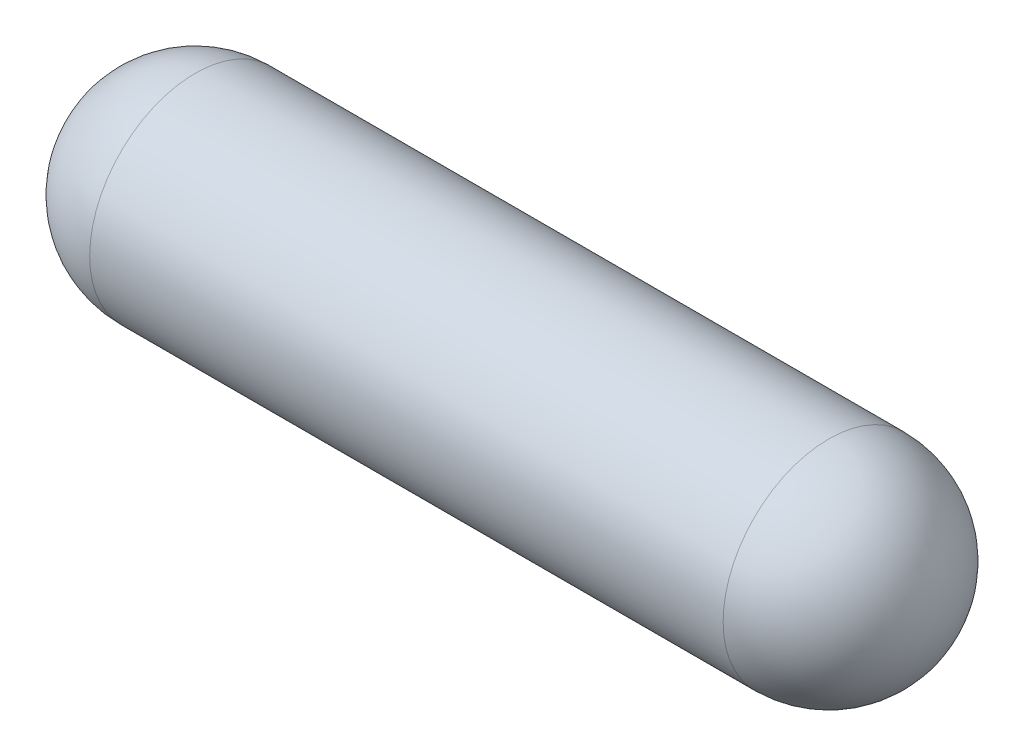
ISO-10303-21;
HEADER;
FILE_DESCRIPTION(('STEP AP214'),'2;1');
FILE_NAME('part.step','',(''),(''),'','','');
FILE_SCHEMA(('AUTOMOTIVE_DESIGN { 1 0 10303 214 1 1 1 1 }'));
ENDSEC;
DATA;
#1=APPLICATION_CONTEXT('core data for automotive mechanical design processes');
#2=APPLICATION_PROTOCOL_DEFINITION('international standard','automotive_design',2000,#1);
#3=PRODUCT_CONTEXT('',#1,'mechanical');
#4=PRODUCT('Part','Part','',(#3));
#5=PRODUCT_RELATED_PRODUCT_CATEGORY('part','',(#4));
#6=PRODUCT_DEFINITION_FORMATION('','',#4);
#7=PRODUCT_DEFINITION_CONTEXT('part definition',#1,'design');
#8=PRODUCT_DEFINITION('design','',#6,#7);
#9=PRODUCT_DEFINITION_SHAPE('','',#8);
#10=(LENGTH_UNIT() NAMED_UNIT(*) SI_UNIT(.MILLI.,.METRE.));
#11=(NAMED_UNIT(*) PLANE_ANGLE_UNIT() SI_UNIT($,.RADIAN.));
#12=(NAMED_UNIT(*) SI_UNIT($,.STERADIAN.) SOLID_ANGLE_UNIT());
#13=UNCERTAINTY_MEASURE_WITH_UNIT(LENGTH_MEASURE(1.E-05),#10,'distance_accuracy_value','');
#14=(GEOMETRIC_REPRESENTATION_CONTEXT(3) GLOBAL_UNCERTAINTY_ASSIGNED_CONTEXT((#13)) GLOBAL_UNIT_ASSIGNED_CONTEXT((#10,
#11,#12)) REPRESENTATION_CONTEXT('',''));
#15=CARTESIAN_POINT('',(0.,0.,0.));
#16=DIRECTION('',(0.,0.,1.));
#17=DIRECTION('',(1.,0.,0.));
#18=AXIS2_PLACEMENT_3D('',#15,#16,#17);
#19=CARTESIAN_POINT('',(-9.,-55.,0.));
#20=DIRECTION('',(1.,0.,0.));
#21=DIRECTION('',(0.,0.,-1.));
#22=AXIS2_PLACEMENT_3D('',#19,#20,#21);
#23=CYLINDRICAL_SURFACE('',#22,1.5);
#24=CARTESIAN_POINT('',(0.,-55.,0.));
#25=DIRECTION('',(1.,0.,0.));
#26=DIRECTION('',(0.,1.,0.));
#27=AXIS2_PLACEMENT_3D('',#24,#25,#26);
#28=CIRCLE('',#27,1.5);
#29=CARTESIAN_POINT('',(0.,-55.,-1.5));
#30=VERTEX_POINT('',#29);
#31=CARTESIAN_POINT('',(0.,-55.,1.5));
#32=VERTEX_POINT('',#31);
#33=EDGE_CURVE('E11',#30,#32,#28,.T.);
#34=ORIENTED_EDGE('',*,*,#33,.F.);
#35=CARTESIAN_POINT('',(0.,-55.,0.));
#36=DIRECTION('',(-1.,0.,0.));
#37=DIRECTION('',(0.,-1.,0.));
#38=AXIS2_PLACEMENT_3D('',#35,#36,#37);
#39=CIRCLE('',#38,1.5);
#40=EDGE_CURVE('E24',#30,#32,#39,.T.);
#41=ORIENTED_EDGE('',*,*,#40,.T.);
#42=EDGE_LOOP('',(#34,#41));
#43=FACE_BOUND('',#42,.T.);
#44=CARTESIAN_POINT('',(-9.,-55.,0.));
#45=DIRECTION('',(1.,0.,0.));
#46=DIRECTION('',(0.,1.,0.));
#47=AXIS2_PLACEMENT_3D('',#44,#45,#46);
#48=CIRCLE('',#47,1.5);
#49=CARTESIAN_POINT('',(-9.,-55.,-1.5));
#50=VERTEX_POINT('',#49);
#51=CARTESIAN_POINT('',(-9.,-55.,1.5));
#52=VERTEX_POINT('',#51);
#53=EDGE_CURVE('E42',#50,#52,#48,.T.);
#54=ORIENTED_EDGE('',*,*,#53,.T.);
#55=CARTESIAN_POINT('',(-9.,-55.,0.));
#56=DIRECTION('',(-1.,0.,0.));
#57=DIRECTION('',(0.,-1.,0.));
#58=AXIS2_PLACEMENT_3D('',#55,#56,#57);
#59=CIRCLE('',#58,1.5);
#60=EDGE_CURVE('E30',#50,#52,#59,.T.);
#61=ORIENTED_EDGE('',*,*,#60,.F.);
#62=EDGE_LOOP('',(#54,#61));
#63=FACE_BOUND('',#62,.T.);
#64=ADVANCED_FACE('F16',(#43,#63),#23,.T.);
#65=CARTESIAN_POINT('',(0.,-55.,0.));
#66=DIRECTION('',(0.,0.,1.));
#67=DIRECTION('',(0.,1.,0.));
#68=AXIS2_PLACEMENT_3D('',#65,#66,#67);
#69=SPHERICAL_SURFACE('',#68,1.5);
#70=CARTESIAN_POINT('',(0.,-55.,0.));
#71=DIRECTION('',(1.,0.,0.));
#72=DIRECTION('',(0.,1.,0.));
#73=AXIS2_PLACEMENT_3D('',#70,#71,#72);
#74=SPHERICAL_SURFACE('',#73,1.5);
#75=ORIENTED_EDGE('',*,*,#33,.T.);
#76=ORIENTED_EDGE('',*,*,#40,.F.);
#77=EDGE_LOOP('',(#75,#76));
#78=FACE_BOUND('',#77,.T.);
#79=ADVANCED_FACE('F80',(#78),#74,.T.);
#80=CARTESIAN_POINT('',(-9.,-55.,0.));
#81=DIRECTION('',(0.,0.,1.));
#82=DIRECTION('',(0.,-1.,0.));
#83=AXIS2_PLACEMENT_3D('',#80,#81,#82);
#84=SPHERICAL_SURFACE('',#83,1.5);
#85=CARTESIAN_POINT('',(-9.,-55.,0.));
#86=DIRECTION('',(-1.,0.,0.));
#87=DIRECTION('',(0.,-1.,0.));
#88=AXIS2_PLACEMENT_3D('',#85,#86,#87);
#89=SPHERICAL_SURFACE('',#88,1.5);
#90=ORIENTED_EDGE('',*,*,#60,.T.);
#91=ORIENTED_EDGE('',*,*,#53,.F.);
#92=EDGE_LOOP('',(#90,#91));
#93=FACE_BOUND('',#92,.T.);
#94=ADVANCED_FACE('F41',(#93),#89,.T.);
#95=CLOSED_SHELL('',(#64,#79,#94));
#96=MANIFOLD_SOLID_BREP('B1',#95);
#97=ADVANCED_BREP_SHAPE_REPRESENTATION('',(#18,#96),#14);
#98=SHAPE_DEFINITION_REPRESENTATION(#9,#97);
ENDSEC;
END-ISO-10303-21;
